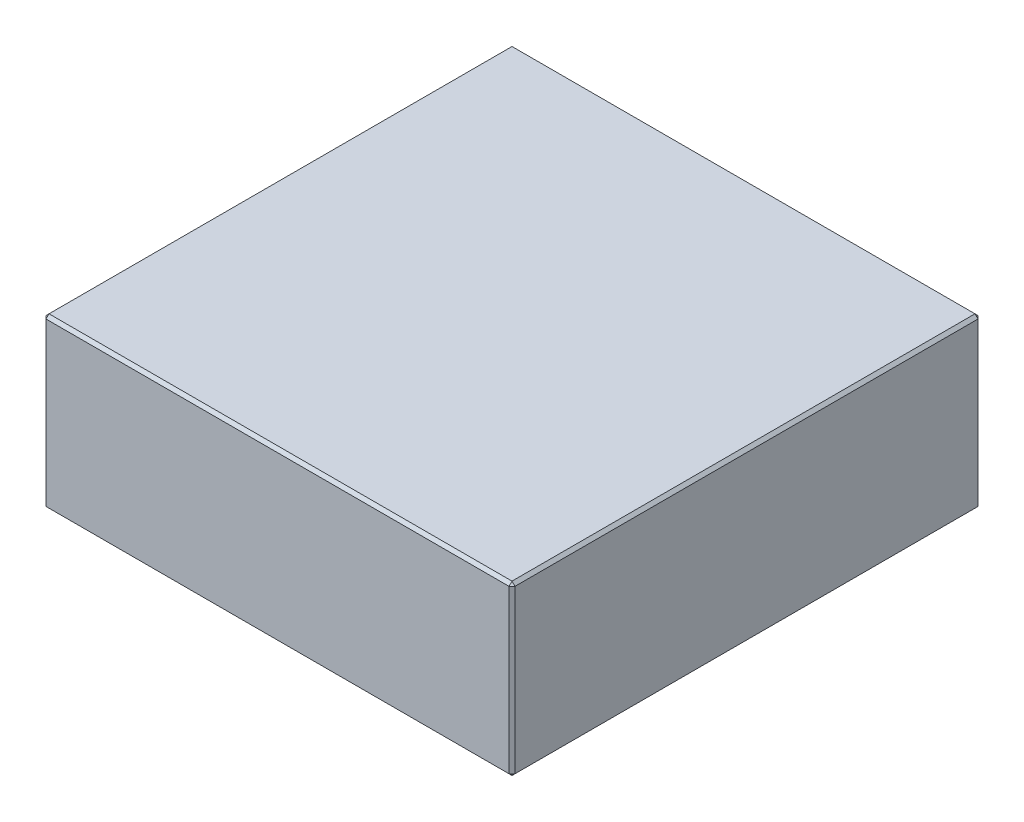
ISO-10303-21;
HEADER;
FILE_DESCRIPTION(('STEP AP214'),'2;1');
FILE_NAME('part.step','',(''),(''),'','','');
FILE_SCHEMA(('AUTOMOTIVE_DESIGN { 1 0 10303 214 1 1 1 1 }'));
ENDSEC;
DATA;
#1=APPLICATION_CONTEXT('core data for automotive mechanical design processes');
#2=APPLICATION_PROTOCOL_DEFINITION('international standard','automotive_design',2000,#1);
#3=PRODUCT_CONTEXT('',#1,'mechanical');
#4=PRODUCT('Part','Part','',(#3));
#5=PRODUCT_RELATED_PRODUCT_CATEGORY('part','',(#4));
#6=PRODUCT_DEFINITION_FORMATION('','',#4);
#7=PRODUCT_DEFINITION_CONTEXT('part definition',#1,'design');
#8=PRODUCT_DEFINITION('design','',#6,#7);
#9=PRODUCT_DEFINITION_SHAPE('','',#8);
#10=(LENGTH_UNIT() NAMED_UNIT(*) SI_UNIT(.MILLI.,.METRE.));
#11=(NAMED_UNIT(*) PLANE_ANGLE_UNIT() SI_UNIT($,.RADIAN.));
#12=(NAMED_UNIT(*) SI_UNIT($,.STERADIAN.) SOLID_ANGLE_UNIT());
#13=UNCERTAINTY_MEASURE_WITH_UNIT(LENGTH_MEASURE(1.E-05),#10,'distance_accuracy_value','');
#14=(GEOMETRIC_REPRESENTATION_CONTEXT(3) GLOBAL_UNCERTAINTY_ASSIGNED_CONTEXT((#13)) GLOBAL_UNIT_ASSIGNED_CONTEXT((#10,
#11,#12)) REPRESENTATION_CONTEXT('',''));
#15=CARTESIAN_POINT('',(0.,0.,0.));
#16=DIRECTION('',(0.,0.,1.));
#17=DIRECTION('',(1.,0.,0.));
#18=AXIS2_PLACEMENT_3D('',#15,#16,#17);
#19=CARTESIAN_POINT('',(-78.,56.,78.));
#20=DIRECTION('',(1.,0.,0.));
#21=DIRECTION('',(0.,0.,-1.));
#22=AXIS2_PLACEMENT_3D('',#19,#20,#21);
#23=PLANE('',#22);
#24=DIRECTION('',(0.,-1.,0.));
#25=VECTOR('',#24,1.);
#26=CARTESIAN_POINT('',(-78.,56.,-77.));
#27=LINE('',#26,#25);
#28=CARTESIAN_POINT('',(-78.,55.,-77.));
#29=VERTEX_POINT('',#28);
#30=CARTESIAN_POINT('',(-78.,1.,-77.));
#31=VERTEX_POINT('',#30);
#32=EDGE_CURVE('E115',#29,#31,#27,.T.);
#33=ORIENTED_EDGE('',*,*,#32,.T.);
#34=DIRECTION('',(0.,0.,1.));
#35=VECTOR('',#34,1.);
#36=CARTESIAN_POINT('',(-78.,1.,78.));
#37=LINE('',#36,#35);
#38=CARTESIAN_POINT('',(-78.,1.,77.));
#39=VERTEX_POINT('',#38);
#40=EDGE_CURVE('E111',#31,#39,#37,.T.);
#41=ORIENTED_EDGE('',*,*,#40,.T.);
#42=DIRECTION('',(0.,1.,0.));
#43=VECTOR('',#42,1.);
#44=CARTESIAN_POINT('',(-78.,56.,77.));
#45=LINE('',#44,#43);
#46=CARTESIAN_POINT('',(-78.,55.,77.));
#47=VERTEX_POINT('',#46);
#48=EDGE_CURVE('E104',#39,#47,#45,.T.);
#49=ORIENTED_EDGE('',*,*,#48,.T.);
#50=DIRECTION('',(0.,0.,-1.));
#51=VECTOR('',#50,1.);
#52=CARTESIAN_POINT('',(-78.,55.,-78.));
#53=LINE('',#52,#51);
#54=EDGE_CURVE('E108',#47,#29,#53,.T.);
#55=ORIENTED_EDGE('',*,*,#54,.T.);
#56=EDGE_LOOP('',(#33,#41,#49,#55));
#57=FACE_BOUND('',#56,.T.);
#58=ADVANCED_FACE('F16',(#57),#23,.F.);
#59=CARTESIAN_POINT('',(78.,56.,78.));
#60=DIRECTION('',(0.,0.,-1.));
#61=DIRECTION('',(-1.,0.,0.));
#62=AXIS2_PLACEMENT_3D('',#59,#60,#61);
#63=PLANE('',#62);
#64=DIRECTION('',(-1.,0.,0.));
#65=VECTOR('',#64,1.);
#66=CARTESIAN_POINT('',(-78.,55.,78.));
#67=LINE('',#66,#65);
#68=CARTESIAN_POINT('',(77.,55.,78.));
#69=VERTEX_POINT('',#68);
#70=CARTESIAN_POINT('',(-77.,55.,78.));
#71=VERTEX_POINT('',#70);
#72=EDGE_CURVE('E165',#69,#71,#67,.T.);
#73=ORIENTED_EDGE('',*,*,#72,.T.);
#74=DIRECTION('',(0.,-1.,0.));
#75=VECTOR('',#74,1.);
#76=CARTESIAN_POINT('',(-77.,56.,78.));
#77=LINE('',#76,#75);
#78=CARTESIAN_POINT('',(-77.,1.,78.));
#79=VERTEX_POINT('',#78);
#80=EDGE_CURVE('E123',#71,#79,#77,.T.);
#81=ORIENTED_EDGE('',*,*,#80,.T.);
#82=DIRECTION('',(1.,0.,0.));
#83=VECTOR('',#82,1.);
#84=CARTESIAN_POINT('',(78.,1.,78.));
#85=LINE('',#84,#83);
#86=CARTESIAN_POINT('',(77.,1.,78.));
#87=VERTEX_POINT('',#86);
#88=EDGE_CURVE('E169',#79,#87,#85,.T.);
#89=ORIENTED_EDGE('',*,*,#88,.T.);
#90=DIRECTION('',(0.,1.,0.));
#91=VECTOR('',#90,1.);
#92=CARTESIAN_POINT('',(77.,56.,78.));
#93=LINE('',#92,#91);
#94=EDGE_CURVE('E167',#87,#69,#93,.T.);
#95=ORIENTED_EDGE('',*,*,#94,.T.);
#96=EDGE_LOOP('',(#73,#81,#89,#95));
#97=FACE_BOUND('',#96,.T.);
#98=ADVANCED_FACE('F276',(#97),#63,.F.);
#99=CARTESIAN_POINT('',(78.,56.,78.));
#100=DIRECTION('',(-1.,0.,0.));
#101=DIRECTION('',(0.,0.,1.));
#102=AXIS2_PLACEMENT_3D('',#99,#100,#101);
#103=PLANE('',#102);
#104=DIRECTION('',(0.,0.,-1.));
#105=VECTOR('',#104,1.);
#106=CARTESIAN_POINT('',(78.,1.,78.));
#107=LINE('',#106,#105);
#108=CARTESIAN_POINT('',(78.,1.,77.));
#109=VERTEX_POINT('',#108);
#110=CARTESIAN_POINT('',(78.,1.,-77.));
#111=VERTEX_POINT('',#110);
#112=EDGE_CURVE('E160',#109,#111,#107,.T.);
#113=ORIENTED_EDGE('',*,*,#112,.T.);
#114=DIRECTION('',(0.,1.,0.));
#115=VECTOR('',#114,1.);
#116=CARTESIAN_POINT('',(78.,56.,-77.));
#117=LINE('',#116,#115);
#118=CARTESIAN_POINT('',(78.,55.,-77.));
#119=VERTEX_POINT('',#118);
#120=EDGE_CURVE('E162',#111,#119,#117,.T.);
#121=ORIENTED_EDGE('',*,*,#120,.T.);
#122=DIRECTION('',(0.,0.,1.));
#123=VECTOR('',#122,1.);
#124=CARTESIAN_POINT('',(78.,55.,78.));
#125=LINE('',#124,#123);
#126=CARTESIAN_POINT('',(78.,55.,77.));
#127=VERTEX_POINT('',#126);
#128=EDGE_CURVE('E156',#119,#127,#125,.T.);
#129=ORIENTED_EDGE('',*,*,#128,.T.);
#130=DIRECTION('',(0.,-1.,0.));
#131=VECTOR('',#130,1.);
#132=CARTESIAN_POINT('',(78.,56.,77.));
#133=LINE('',#132,#131);
#134=EDGE_CURVE('E158',#127,#109,#133,.T.);
#135=ORIENTED_EDGE('',*,*,#134,.T.);
#136=EDGE_LOOP('',(#113,#121,#129,#135));
#137=FACE_BOUND('',#136,.T.);
#138=ADVANCED_FACE('F255',(#137),#103,.F.);
#139=CARTESIAN_POINT('',(78.,56.,-78.));
#140=DIRECTION('',(0.,0.,1.));
#141=DIRECTION('',(1.,0.,0.));
#142=AXIS2_PLACEMENT_3D('',#139,#140,#141);
#143=PLANE('',#142);
#144=DIRECTION('',(0.,-1.,0.));
#145=VECTOR('',#144,1.);
#146=CARTESIAN_POINT('',(77.,56.,-78.));
#147=LINE('',#146,#145);
#148=CARTESIAN_POINT('',(77.,55.,-78.));
#149=VERTEX_POINT('',#148);
#150=CARTESIAN_POINT('',(77.,1.,-78.));
#151=VERTEX_POINT('',#150);
#152=EDGE_CURVE('E149',#149,#151,#147,.T.);
#153=ORIENTED_EDGE('',*,*,#152,.T.);
#154=DIRECTION('',(-1.,0.,0.));
#155=VECTOR('',#154,1.);
#156=CARTESIAN_POINT('',(78.,1.,-78.));
#157=LINE('',#156,#155);
#158=CARTESIAN_POINT('',(-77.,1.,-78.));
#159=VERTEX_POINT('',#158);
#160=EDGE_CURVE('E154',#151,#159,#157,.T.);
#161=ORIENTED_EDGE('',*,*,#160,.T.);
#162=DIRECTION('',(0.,1.,0.));
#163=VECTOR('',#162,1.);
#164=CARTESIAN_POINT('',(-77.,56.,-78.));
#165=LINE('',#164,#163);
#166=CARTESIAN_POINT('',(-77.,55.,-78.));
#167=VERTEX_POINT('',#166);
#168=EDGE_CURVE('E151',#159,#167,#165,.T.);
#169=ORIENTED_EDGE('',*,*,#168,.T.);
#170=DIRECTION('',(1.,0.,0.));
#171=VECTOR('',#170,1.);
#172=CARTESIAN_POINT('',(78.,55.,-78.));
#173=LINE('',#172,#171);
#174=EDGE_CURVE('E147',#167,#149,#173,.T.);
#175=ORIENTED_EDGE('',*,*,#174,.T.);
#176=EDGE_LOOP('',(#153,#161,#169,#175));
#177=FACE_BOUND('',#176,.T.);
#178=ADVANCED_FACE('F285',(#177),#143,.F.);
#179=CARTESIAN_POINT('',(0.,56.,0.));
#180=DIRECTION('',(0.,1.,0.));
#181=DIRECTION('',(0.,0.,1.));
#182=AXIS2_PLACEMENT_3D('',#179,#180,#181);
#183=PLANE('',#182);
#184=DIRECTION('',(0.,0.,-1.));
#185=VECTOR('',#184,1.);
#186=CARTESIAN_POINT('',(77.,56.,-78.));
#187=LINE('',#186,#185);
#188=CARTESIAN_POINT('',(77.,56.,77.));
#189=VERTEX_POINT('',#188);
#190=CARTESIAN_POINT('',(77.,56.,-77.));
#191=VERTEX_POINT('',#190);
#192=EDGE_CURVE('E25',#189,#191,#187,.T.);
#193=ORIENTED_EDGE('',*,*,#192,.T.);
#194=DIRECTION('',(-1.,0.,0.));
#195=VECTOR('',#194,1.);
#196=CARTESIAN_POINT('',(-78.,56.,-77.));
#197=LINE('',#196,#195);
#198=CARTESIAN_POINT('',(-77.,56.,-77.));
#199=VERTEX_POINT('',#198);
#200=EDGE_CURVE('E10',#191,#199,#197,.T.);
#201=ORIENTED_EDGE('',*,*,#200,.T.);
#202=DIRECTION('',(0.,0.,1.));
#203=VECTOR('',#202,1.);
#204=CARTESIAN_POINT('',(-77.,56.,78.));
#205=LINE('',#204,#203);
#206=CARTESIAN_POINT('',(-77.,56.,77.));
#207=VERTEX_POINT('',#206);
#208=EDGE_CURVE('E181',#199,#207,#205,.T.);
#209=ORIENTED_EDGE('',*,*,#208,.T.);
#210=DIRECTION('',(1.,0.,0.));
#211=VECTOR('',#210,1.);
#212=CARTESIAN_POINT('',(78.,56.,77.));
#213=LINE('',#212,#211);
#214=EDGE_CURVE('E36',#207,#189,#213,.T.);
#215=ORIENTED_EDGE('',*,*,#214,.T.);
#216=EDGE_LOOP('',(#193,#201,#209,#215));
#217=FACE_BOUND('',#216,.T.);
#218=ADVANCED_FACE('F351',(#217),#183,.T.);
#219=CARTESIAN_POINT('',(0.,0.,0.));
#220=DIRECTION('',(0.,1.,0.));
#221=DIRECTION('',(0.,0.,1.));
#222=AXIS2_PLACEMENT_3D('',#219,#220,#221);
#223=PLANE('',#222);
#224=DIRECTION('',(0.,0.,1.));
#225=VECTOR('',#224,1.);
#226=CARTESIAN_POINT('',(77.,0.,0.));
#227=LINE('',#226,#225);
#228=CARTESIAN_POINT('',(77.,0.,-77.));
#229=VERTEX_POINT('',#228);
#230=CARTESIAN_POINT('',(77.,0.,77.));
#231=VERTEX_POINT('',#230);
#232=EDGE_CURVE('E172',#229,#231,#227,.T.);
#233=ORIENTED_EDGE('',*,*,#232,.T.);
#234=DIRECTION('',(-1.,0.,0.));
#235=VECTOR('',#234,1.);
#236=CARTESIAN_POINT('',(0.,0.,77.));
#237=LINE('',#236,#235);
#238=CARTESIAN_POINT('',(-77.,0.,77.));
#239=VERTEX_POINT('',#238);
#240=EDGE_CURVE('E178',#231,#239,#237,.T.);
#241=ORIENTED_EDGE('',*,*,#240,.T.);
#242=DIRECTION('',(0.,0.,-1.));
#243=VECTOR('',#242,1.);
#244=CARTESIAN_POINT('',(-77.,0.,0.));
#245=LINE('',#244,#243);
#246=CARTESIAN_POINT('',(-77.,0.,-77.));
#247=VERTEX_POINT('',#246);
#248=EDGE_CURVE('E176',#239,#247,#245,.T.);
#249=ORIENTED_EDGE('',*,*,#248,.T.);
#250=DIRECTION('',(1.,0.,0.));
#251=VECTOR('',#250,1.);
#252=CARTESIAN_POINT('',(0.,0.,-77.));
#253=LINE('',#252,#251);
#254=EDGE_CURVE('E174',#247,#229,#253,.T.);
#255=ORIENTED_EDGE('',*,*,#254,.T.);
#256=EDGE_LOOP('',(#233,#241,#249,#255));
#257=FACE_BOUND('',#256,.T.);
#258=ADVANCED_FACE('F247',(#257),#223,.F.);
#259=CARTESIAN_POINT('',(78.,56.,77.));
#260=DIRECTION('',(-0.707106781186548,0.,-0.707106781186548));
#261=DIRECTION('',(0.,-1.,0.));
#262=AXIS2_PLACEMENT_3D('',#259,#260,#261);
#263=PLANE('',#262);
#264=DIRECTION('',(-0.707106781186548,0.,0.707106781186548));
#265=VECTOR('',#264,1.);
#266=CARTESIAN_POINT('',(77.,55.,78.));
#267=LINE('',#266,#265);
#268=EDGE_CURVE('E20',#69,#127,#267,.F.);
#269=ORIENTED_EDGE('',*,*,#268,.F.);
#270=ORIENTED_EDGE('',*,*,#94,.F.);
#271=DIRECTION('',(0.707106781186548,0.,-0.707106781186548));
#272=VECTOR('',#271,1.);
#273=CARTESIAN_POINT('',(77.,1.,78.));
#274=LINE('',#273,#272);
#275=EDGE_CURVE('E143',#109,#87,#274,.F.);
#276=ORIENTED_EDGE('',*,*,#275,.F.);
#277=ORIENTED_EDGE('',*,*,#134,.F.);
#278=EDGE_LOOP('',(#269,#270,#276,#277));
#279=FACE_BOUND('',#278,.T.);
#280=ADVANCED_FACE('F18',(#279),#263,.F.);
#281=CARTESIAN_POINT('',(77.,55.,78.));
#282=DIRECTION('',(0.577350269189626,0.577350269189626,0.577350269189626));
#283=DIRECTION('',(0.707106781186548,0.,-0.707106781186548));
#284=AXIS2_PLACEMENT_3D('',#281,#282,#283);
#285=PLANE('',#284);
#286=DIRECTION('',(0.,-0.707106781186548,0.707106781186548));
#287=VECTOR('',#286,1.);
#288=CARTESIAN_POINT('',(77.,55.,78.));
#289=LINE('',#288,#287);
#290=EDGE_CURVE('E227',#69,#189,#289,.F.);
#291=ORIENTED_EDGE('',*,*,#290,.F.);
#292=ORIENTED_EDGE('',*,*,#268,.T.);
#293=DIRECTION('',(-0.707106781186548,0.707106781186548,0.));
#294=VECTOR('',#293,1.);
#295=CARTESIAN_POINT('',(77.5,55.5,77.));
#296=LINE('',#295,#294);
#297=EDGE_CURVE('E229',#189,#127,#296,.F.);
#298=ORIENTED_EDGE('',*,*,#297,.F.);
#299=EDGE_LOOP('',(#291,#292,#298));
#300=FACE_BOUND('',#299,.T.);
#301=ADVANCED_FACE('F271',(#300),#285,.T.);
#302=CARTESIAN_POINT('',(77.,1.,78.));
#303=DIRECTION('',(0.577350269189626,-0.577350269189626,0.577350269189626));
#304=DIRECTION('',(0.707106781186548,0.,-0.707106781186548));
#305=AXIS2_PLACEMENT_3D('',#302,#303,#304);
#306=PLANE('',#305);
#307=DIRECTION('',(-0.707106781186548,-0.707106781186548,0.));
#308=VECTOR('',#307,1.);
#309=CARTESIAN_POINT('',(77.5,0.5,77.));
#310=LINE('',#309,#308);
#311=EDGE_CURVE('E221',#109,#231,#310,.T.);
#312=ORIENTED_EDGE('',*,*,#311,.F.);
#313=ORIENTED_EDGE('',*,*,#275,.T.);
#314=DIRECTION('',(0.,0.707106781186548,0.707106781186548));
#315=VECTOR('',#314,1.);
#316=CARTESIAN_POINT('',(77.,1.,78.));
#317=LINE('',#316,#315);
#318=EDGE_CURVE('E224',#231,#87,#317,.T.);
#319=ORIENTED_EDGE('',*,*,#318,.F.);
#320=EDGE_LOOP('',(#312,#313,#319));
#321=FACE_BOUND('',#320,.T.);
#322=ADVANCED_FACE('F236',(#321),#306,.T.);
#323=CARTESIAN_POINT('',(77.,56.,0.));
#324=DIRECTION('',(0.707106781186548,0.707106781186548,0.));
#325=DIRECTION('',(0.,0.,1.));
#326=AXIS2_PLACEMENT_3D('',#323,#324,#325);
#327=PLANE('',#326);
#328=ORIENTED_EDGE('',*,*,#297,.T.);
#329=ORIENTED_EDGE('',*,*,#128,.F.);
#330=DIRECTION('',(0.707106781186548,-0.707106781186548,0.));
#331=VECTOR('',#330,1.);
#332=CARTESIAN_POINT('',(78.,55.,-77.));
#333=LINE('',#332,#331);
#334=EDGE_CURVE('E216',#191,#119,#333,.T.);
#335=ORIENTED_EDGE('',*,*,#334,.F.);
#336=ORIENTED_EDGE('',*,*,#192,.F.);
#337=EDGE_LOOP('',(#328,#329,#335,#336));
#338=FACE_BOUND('',#337,.T.);
#339=ADVANCED_FACE('F266',(#338),#327,.T.);
#340=CARTESIAN_POINT('',(0.,56.,77.));
#341=DIRECTION('',(0.,0.707106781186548,0.707106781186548));
#342=DIRECTION('',(-1.,0.,0.));
#343=AXIS2_PLACEMENT_3D('',#340,#341,#342);
#344=PLANE('',#343);
#345=ORIENTED_EDGE('',*,*,#290,.T.);
#346=ORIENTED_EDGE('',*,*,#214,.F.);
#347=DIRECTION('',(0.,0.707106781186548,-0.707106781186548));
#348=VECTOR('',#347,1.);
#349=CARTESIAN_POINT('',(-77.,55.5,77.5));
#350=LINE('',#349,#348);
#351=EDGE_CURVE('E127',#71,#207,#350,.T.);
#352=ORIENTED_EDGE('',*,*,#351,.F.);
#353=ORIENTED_EDGE('',*,*,#72,.F.);
#354=EDGE_LOOP('',(#345,#346,#352,#353));
#355=FACE_BOUND('',#354,.T.);
#356=ADVANCED_FACE('F274',(#355),#344,.T.);
#357=CARTESIAN_POINT('',(-77.,56.,78.));
#358=DIRECTION('',(0.707106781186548,0.,-0.707106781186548));
#359=DIRECTION('',(0.,-1.,0.));
#360=AXIS2_PLACEMENT_3D('',#357,#358,#359);
#361=PLANE('',#360);
#362=DIRECTION('',(0.707106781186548,0.,0.707106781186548));
#363=VECTOR('',#362,1.);
#364=CARTESIAN_POINT('',(-77.,1.,78.));
#365=LINE('',#364,#363);
#366=EDGE_CURVE('E128',#79,#39,#365,.F.);
#367=ORIENTED_EDGE('',*,*,#366,.F.);
#368=ORIENTED_EDGE('',*,*,#80,.F.);
#369=DIRECTION('',(-0.707106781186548,0.,-0.707106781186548));
#370=VECTOR('',#369,1.);
#371=CARTESIAN_POINT('',(-78.,55.,77.));
#372=LINE('',#371,#370);
#373=EDGE_CURVE('E119',#47,#71,#372,.F.);
#374=ORIENTED_EDGE('',*,*,#373,.F.);
#375=ORIENTED_EDGE('',*,*,#48,.F.);
#376=EDGE_LOOP('',(#367,#368,#374,#375));
#377=FACE_BOUND('',#376,.T.);
#378=ADVANCED_FACE('F121',(#377),#361,.F.);
#379=CARTESIAN_POINT('',(78.,1.,78.));
#380=DIRECTION('',(0.,0.707106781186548,-0.707106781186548));
#381=DIRECTION('',(1.,0.,0.));
#382=AXIS2_PLACEMENT_3D('',#379,#380,#381);
#383=PLANE('',#382);
#384=ORIENTED_EDGE('',*,*,#318,.T.);
#385=ORIENTED_EDGE('',*,*,#88,.F.);
#386=DIRECTION('',(0.,-0.707106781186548,-0.707106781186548));
#387=VECTOR('',#386,1.);
#388=CARTESIAN_POINT('',(-77.,1.,78.));
#389=LINE('',#388,#387);
#390=EDGE_CURVE('E212',#239,#79,#389,.F.);
#391=ORIENTED_EDGE('',*,*,#390,.F.);
#392=ORIENTED_EDGE('',*,*,#240,.F.);
#393=EDGE_LOOP('',(#384,#385,#391,#392));
#394=FACE_BOUND('',#393,.T.);
#395=ADVANCED_FACE('F244',(#394),#383,.F.);
#396=CARTESIAN_POINT('',(78.,1.,78.));
#397=DIRECTION('',(-0.707106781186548,0.707106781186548,0.));
#398=DIRECTION('',(0.,0.,-1.));
#399=AXIS2_PLACEMENT_3D('',#396,#397,#398);
#400=PLANE('',#399);
#401=ORIENTED_EDGE('',*,*,#311,.T.);
#402=ORIENTED_EDGE('',*,*,#232,.F.);
#403=DIRECTION('',(0.707106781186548,0.707106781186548,0.));
#404=VECTOR('',#403,1.);
#405=CARTESIAN_POINT('',(77.5,0.5,-77.));
#406=LINE('',#405,#404);
#407=EDGE_CURVE('E209',#111,#229,#406,.F.);
#408=ORIENTED_EDGE('',*,*,#407,.F.);
#409=ORIENTED_EDGE('',*,*,#112,.F.);
#410=EDGE_LOOP('',(#401,#402,#408,#409));
#411=FACE_BOUND('',#410,.T.);
#412=ADVANCED_FACE('F252',(#411),#400,.F.);
#413=CARTESIAN_POINT('',(77.,56.,-78.));
#414=DIRECTION('',(-0.707106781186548,0.,0.707106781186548));
#415=DIRECTION('',(0.,-1.,0.));
#416=AXIS2_PLACEMENT_3D('',#413,#414,#415);
#417=PLANE('',#416);
#418=DIRECTION('',(0.707106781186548,0.,0.707106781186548));
#419=VECTOR('',#418,1.);
#420=CARTESIAN_POINT('',(78.,55.,-77.));
#421=LINE('',#420,#419);
#422=EDGE_CURVE('E218',#119,#149,#421,.F.);
#423=ORIENTED_EDGE('',*,*,#422,.F.);
#424=ORIENTED_EDGE('',*,*,#120,.F.);
#425=DIRECTION('',(-0.707106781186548,0.,-0.707106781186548));
#426=VECTOR('',#425,1.);
#427=CARTESIAN_POINT('',(77.,1.,-78.));
#428=LINE('',#427,#426);
#429=EDGE_CURVE('E206',#151,#111,#428,.F.);
#430=ORIENTED_EDGE('',*,*,#429,.F.);
#431=ORIENTED_EDGE('',*,*,#152,.F.);
#432=EDGE_LOOP('',(#423,#424,#430,#431));
#433=FACE_BOUND('',#432,.T.);
#434=ADVANCED_FACE('F259',(#433),#417,.F.);
#435=CARTESIAN_POINT('',(78.,55.,-77.));
#436=DIRECTION('',(0.577350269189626,0.577350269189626,-0.577350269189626));
#437=DIRECTION('',(-0.707106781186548,0.,-0.707106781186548));
#438=AXIS2_PLACEMENT_3D('',#435,#436,#437);
#439=PLANE('',#438);
#440=ORIENTED_EDGE('',*,*,#334,.T.);
#441=ORIENTED_EDGE('',*,*,#422,.T.);
#442=DIRECTION('',(0.,0.707106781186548,0.707106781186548));
#443=VECTOR('',#442,1.);
#444=CARTESIAN_POINT('',(77.,55.5,-77.5));
#445=LINE('',#444,#443);
#446=EDGE_CURVE('E135',#191,#149,#445,.F.);
#447=ORIENTED_EDGE('',*,*,#446,.F.);
#448=EDGE_LOOP('',(#440,#441,#447));
#449=FACE_BOUND('',#448,.T.);
#450=ADVANCED_FACE('F326',(#449),#439,.T.);
#451=CARTESIAN_POINT('',(-78.,55.,77.));
#452=DIRECTION('',(-0.577350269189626,0.577350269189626,0.577350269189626));
#453=DIRECTION('',(0.707106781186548,0.,0.707106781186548));
#454=AXIS2_PLACEMENT_3D('',#451,#452,#453);
#455=PLANE('',#454);
#456=ORIENTED_EDGE('',*,*,#373,.T.);
#457=ORIENTED_EDGE('',*,*,#351,.T.);
#458=DIRECTION('',(-0.707106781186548,-0.707106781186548,0.));
#459=VECTOR('',#458,1.);
#460=CARTESIAN_POINT('',(-78.,55.,77.));
#461=LINE('',#460,#459);
#462=EDGE_CURVE('E131',#47,#207,#461,.F.);
#463=ORIENTED_EDGE('',*,*,#462,.F.);
#464=EDGE_LOOP('',(#456,#457,#463));
#465=FACE_BOUND('',#464,.T.);
#466=ADVANCED_FACE('F132',(#465),#455,.T.);
#467=CARTESIAN_POINT('',(-77.,1.,78.));
#468=DIRECTION('',(-0.577350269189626,-0.577350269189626,0.577350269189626));
#469=DIRECTION('',(0.707106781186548,0.,0.707106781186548));
#470=AXIS2_PLACEMENT_3D('',#467,#468,#469);
#471=PLANE('',#470);
#472=ORIENTED_EDGE('',*,*,#390,.T.);
#473=ORIENTED_EDGE('',*,*,#366,.T.);
#474=DIRECTION('',(-0.707106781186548,0.707106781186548,0.));
#475=VECTOR('',#474,1.);
#476=CARTESIAN_POINT('',(-77.5,0.5,77.));
#477=LINE('',#476,#475);
#478=EDGE_CURVE('E136',#239,#39,#477,.T.);
#479=ORIENTED_EDGE('',*,*,#478,.F.);
#480=EDGE_LOOP('',(#472,#473,#479));
#481=FACE_BOUND('',#480,.T.);
#482=ADVANCED_FACE('F319',(#481),#471,.T.);
#483=CARTESIAN_POINT('',(77.,1.,-78.));
#484=DIRECTION('',(0.577350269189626,-0.577350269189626,-0.577350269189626));
#485=DIRECTION('',(-0.707106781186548,0.,-0.707106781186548));
#486=AXIS2_PLACEMENT_3D('',#483,#484,#485);
#487=PLANE('',#486);
#488=ORIENTED_EDGE('',*,*,#429,.T.);
#489=ORIENTED_EDGE('',*,*,#407,.T.);
#490=DIRECTION('',(0.,-0.707106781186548,0.707106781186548));
#491=VECTOR('',#490,1.);
#492=CARTESIAN_POINT('',(77.,1.,-78.));
#493=LINE('',#492,#491);
#494=EDGE_CURVE('E199',#151,#229,#493,.T.);
#495=ORIENTED_EDGE('',*,*,#494,.F.);
#496=EDGE_LOOP('',(#488,#489,#495));
#497=FACE_BOUND('',#496,.T.);
#498=ADVANCED_FACE('F315',(#497),#487,.T.);
#499=CARTESIAN_POINT('',(0.,56.,-77.));
#500=DIRECTION('',(0.,0.707106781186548,-0.707106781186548));
#501=DIRECTION('',(1.,0.,0.));
#502=AXIS2_PLACEMENT_3D('',#499,#500,#501);
#503=PLANE('',#502);
#504=ORIENTED_EDGE('',*,*,#446,.T.);
#505=ORIENTED_EDGE('',*,*,#174,.F.);
#506=DIRECTION('',(0.,-0.707106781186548,-0.707106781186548));
#507=VECTOR('',#506,1.);
#508=CARTESIAN_POINT('',(-77.,55.,-78.));
#509=LINE('',#508,#507);
#510=EDGE_CURVE('E196',#199,#167,#509,.T.);
#511=ORIENTED_EDGE('',*,*,#510,.F.);
#512=ORIENTED_EDGE('',*,*,#200,.F.);
#513=EDGE_LOOP('',(#504,#505,#511,#512));
#514=FACE_BOUND('',#513,.T.);
#515=ADVANCED_FACE('F312',(#514),#503,.T.);
#516=CARTESIAN_POINT('',(-77.,56.,0.));
#517=DIRECTION('',(-0.707106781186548,0.707106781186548,0.));
#518=DIRECTION('',(0.,0.,-1.));
#519=AXIS2_PLACEMENT_3D('',#516,#517,#518);
#520=PLANE('',#519);
#521=ORIENTED_EDGE('',*,*,#462,.T.);
#522=ORIENTED_EDGE('',*,*,#208,.F.);
#523=DIRECTION('',(0.707106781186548,0.707106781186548,0.));
#524=VECTOR('',#523,1.);
#525=CARTESIAN_POINT('',(-77.5,55.5,-77.));
#526=LINE('',#525,#524);
#527=EDGE_CURVE('E139',#29,#199,#526,.T.);
#528=ORIENTED_EDGE('',*,*,#527,.F.);
#529=ORIENTED_EDGE('',*,*,#54,.F.);
#530=EDGE_LOOP('',(#521,#522,#528,#529));
#531=FACE_BOUND('',#530,.T.);
#532=ADVANCED_FACE('F138',(#531),#520,.T.);
#533=CARTESIAN_POINT('',(-78.,1.,78.));
#534=DIRECTION('',(0.707106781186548,0.707106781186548,0.));
#535=DIRECTION('',(0.,0.,1.));
#536=AXIS2_PLACEMENT_3D('',#533,#534,#535);
#537=PLANE('',#536);
#538=ORIENTED_EDGE('',*,*,#478,.T.);
#539=ORIENTED_EDGE('',*,*,#40,.F.);
#540=DIRECTION('',(0.707106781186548,-0.707106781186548,0.));
#541=VECTOR('',#540,1.);
#542=CARTESIAN_POINT('',(-78.,1.,-77.));
#543=LINE('',#542,#541);
#544=EDGE_CURVE('E192',#247,#31,#543,.F.);
#545=ORIENTED_EDGE('',*,*,#544,.F.);
#546=ORIENTED_EDGE('',*,*,#248,.F.);
#547=EDGE_LOOP('',(#538,#539,#545,#546));
#548=FACE_BOUND('',#547,.T.);
#549=ADVANCED_FACE('F305',(#548),#537,.F.);
#550=CARTESIAN_POINT('',(78.,1.,-78.));
#551=DIRECTION('',(0.,0.707106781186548,0.707106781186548));
#552=DIRECTION('',(-1.,0.,0.));
#553=AXIS2_PLACEMENT_3D('',#550,#551,#552);
#554=PLANE('',#553);
#555=ORIENTED_EDGE('',*,*,#494,.T.);
#556=ORIENTED_EDGE('',*,*,#254,.F.);
#557=DIRECTION('',(0.,0.707106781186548,-0.707106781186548));
#558=VECTOR('',#557,1.);
#559=CARTESIAN_POINT('',(-77.,0.5,-77.5));
#560=LINE('',#559,#558);
#561=EDGE_CURVE('E189',#159,#247,#560,.F.);
#562=ORIENTED_EDGE('',*,*,#561,.F.);
#563=ORIENTED_EDGE('',*,*,#160,.F.);
#564=EDGE_LOOP('',(#555,#556,#562,#563));
#565=FACE_BOUND('',#564,.T.);
#566=ADVANCED_FACE('F301',(#565),#554,.F.);
#567=CARTESIAN_POINT('',(-77.,55.,-78.));
#568=DIRECTION('',(-0.577350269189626,0.577350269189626,-0.577350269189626));
#569=DIRECTION('',(-0.707106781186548,0.,0.707106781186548));
#570=AXIS2_PLACEMENT_3D('',#567,#568,#569);
#571=PLANE('',#570);
#572=ORIENTED_EDGE('',*,*,#527,.T.);
#573=ORIENTED_EDGE('',*,*,#510,.T.);
#574=DIRECTION('',(0.707106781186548,0.,-0.707106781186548));
#575=VECTOR('',#574,1.);
#576=CARTESIAN_POINT('',(-77.,55.,-78.));
#577=LINE('',#576,#575);
#578=EDGE_CURVE('E187',#29,#167,#577,.T.);
#579=ORIENTED_EDGE('',*,*,#578,.F.);
#580=EDGE_LOOP('',(#572,#573,#579));
#581=FACE_BOUND('',#580,.T.);
#582=ADVANCED_FACE('F297',(#581),#571,.T.);
#583=CARTESIAN_POINT('',(-78.,1.,-77.));
#584=DIRECTION('',(-0.577350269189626,-0.577350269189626,-0.577350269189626));
#585=DIRECTION('',(-0.707106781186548,0.,0.707106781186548));
#586=AXIS2_PLACEMENT_3D('',#583,#584,#585);
#587=PLANE('',#586);
#588=ORIENTED_EDGE('',*,*,#561,.T.);
#589=ORIENTED_EDGE('',*,*,#544,.T.);
#590=DIRECTION('',(-0.707106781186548,0.,0.707106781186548));
#591=VECTOR('',#590,1.);
#592=CARTESIAN_POINT('',(-78.,1.,-77.));
#593=LINE('',#592,#591);
#594=EDGE_CURVE('E185',#159,#31,#593,.T.);
#595=ORIENTED_EDGE('',*,*,#594,.F.);
#596=EDGE_LOOP('',(#588,#589,#595));
#597=FACE_BOUND('',#596,.T.);
#598=ADVANCED_FACE('F293',(#597),#587,.T.);
#599=CARTESIAN_POINT('',(-78.,56.,-77.));
#600=DIRECTION('',(0.707106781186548,0.,0.707106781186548));
#601=DIRECTION('',(0.,-1.,0.));
#602=AXIS2_PLACEMENT_3D('',#599,#600,#601);
#603=PLANE('',#602);
#604=ORIENTED_EDGE('',*,*,#578,.T.);
#605=ORIENTED_EDGE('',*,*,#168,.F.);
#606=ORIENTED_EDGE('',*,*,#594,.T.);
#607=ORIENTED_EDGE('',*,*,#32,.F.);
#608=EDGE_LOOP('',(#604,#605,#606,#607));
#609=FACE_BOUND('',#608,.T.);
#610=ADVANCED_FACE('F290',(#609),#603,.F.);
#611=CLOSED_SHELL('',(#58,#98,#138,#178,#218,#258,#280,#301,#322,#339,#356,#378,#395,#412,#434,
#450,#466,#482,#498,#515,#532,#549,#566,#582,#598,#610));
#612=MANIFOLD_SOLID_BREP('B1',#611);
#613=ADVANCED_BREP_SHAPE_REPRESENTATION('',(#18,#612),#14);
#614=SHAPE_DEFINITION_REPRESENTATION(#9,#613);
ENDSEC;
END-ISO-10303-21;
